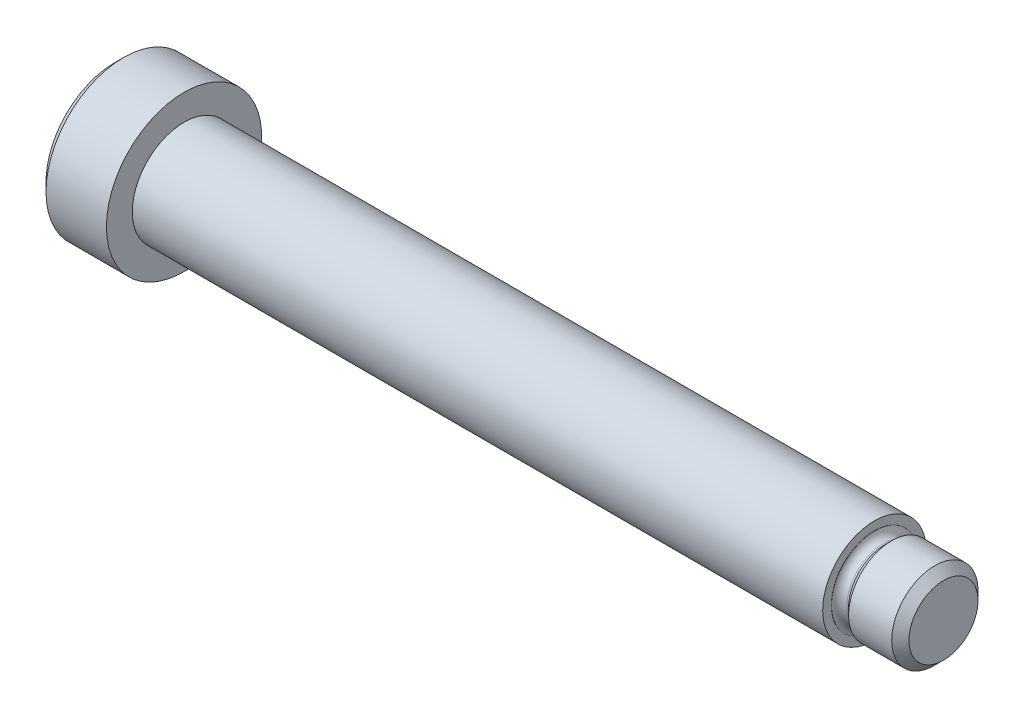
ISO-10303-21;
HEADER;
FILE_DESCRIPTION(('STEP AP214'),'2;1');
FILE_NAME('part.step','',(''),(''),'','','');
FILE_SCHEMA(('AUTOMOTIVE_DESIGN { 1 0 10303 214 1 1 1 1 }'));
ENDSEC;
DATA;
#1=APPLICATION_CONTEXT('core data for automotive mechanical design processes');
#2=APPLICATION_PROTOCOL_DEFINITION('international standard','automotive_design',2000,#1);
#3=PRODUCT_CONTEXT('',#1,'mechanical');
#4=PRODUCT('Part','Part','',(#3));
#5=PRODUCT_RELATED_PRODUCT_CATEGORY('part','',(#4));
#6=PRODUCT_DEFINITION_FORMATION('','',#4);
#7=PRODUCT_DEFINITION_CONTEXT('part definition',#1,'design');
#8=PRODUCT_DEFINITION('design','',#6,#7);
#9=PRODUCT_DEFINITION_SHAPE('','',#8);
#10=(LENGTH_UNIT() NAMED_UNIT(*) SI_UNIT(.MILLI.,.METRE.));
#11=(NAMED_UNIT(*) PLANE_ANGLE_UNIT() SI_UNIT($,.RADIAN.));
#12=(NAMED_UNIT(*) SI_UNIT($,.STERADIAN.) SOLID_ANGLE_UNIT());
#13=UNCERTAINTY_MEASURE_WITH_UNIT(LENGTH_MEASURE(1.E-05),#10,'distance_accuracy_value','');
#14=(GEOMETRIC_REPRESENTATION_CONTEXT(3) GLOBAL_UNCERTAINTY_ASSIGNED_CONTEXT((#13)) GLOBAL_UNIT_ASSIGNED_CONTEXT((#10,
#11,#12)) REPRESENTATION_CONTEXT('',''));
#15=CARTESIAN_POINT('',(0.,0.,0.));
#16=DIRECTION('',(0.,0.,1.));
#17=DIRECTION('',(1.,0.,0.));
#18=AXIS2_PLACEMENT_3D('',#15,#16,#17);
#19=CARTESIAN_POINT('',(0.,0.,0.));
#20=DIRECTION('',(-1.,0.,0.));
#21=DIRECTION('',(0.,0.,1.));
#22=AXIS2_PLACEMENT_3D('',#19,#20,#21);
#23=CYLINDRICAL_SURFACE('',#22,2.5);
#24=CARTESIAN_POINT('',(44.,0.,0.));
#25=DIRECTION('',(-1.,0.,0.));
#26=DIRECTION('',(0.,0.,1.));
#27=AXIS2_PLACEMENT_3D('',#24,#25,#26);
#28=CIRCLE('',#27,2.5);
#29=CARTESIAN_POINT('',(44.,0.,2.5));
#30=VERTEX_POINT('',#29);
#31=EDGE_CURVE('E144',#30,#30,#28,.T.);
#32=ORIENTED_EDGE('',*,*,#31,.F.);
#33=EDGE_LOOP('',(#32));
#34=FACE_BOUND('',#33,.T.);
#35=CARTESIAN_POINT('',(44.0101020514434,0.,0.));
#36=DIRECTION('',(1.,0.,0.));
#37=DIRECTION('',(0.,0.,-1.));
#38=AXIS2_PLACEMENT_3D('',#35,#36,#37);
#39=CIRCLE('',#38,2.5);
#40=CARTESIAN_POINT('',(44.0101020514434,0.,-2.5));
#41=VERTEX_POINT('',#40);
#42=EDGE_CURVE('E45',#41,#41,#39,.T.);
#43=ORIENTED_EDGE('',*,*,#42,.F.);
#44=EDGE_LOOP('',(#43));
#45=FACE_BOUND('',#44,.T.);
#46=ADVANCED_FACE('F41',(#34,#45),#23,.T.);
#47=CARTESIAN_POINT('',(0.,0.,0.));
#48=DIRECTION('',(1.,0.,0.));
#49=DIRECTION('',(0.,0.,-1.));
#50=AXIS2_PLACEMENT_3D('',#47,#48,#49);
#51=PLANE('',#50);
#52=DIRECTION('',(0.,0.5,0.866025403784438));
#53=VECTOR('',#52,1.);
#54=CARTESIAN_POINT('',(0.,-2.36713610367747,0.));
#55=LINE('',#54,#53);
#56=CARTESIAN_POINT('',(0.,-2.36713610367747,0.));
#57=VERTEX_POINT('',#56);
#58=CARTESIAN_POINT('',(0.,-1.18356805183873,2.05));
#59=VERTEX_POINT('',#58);
#60=EDGE_CURVE('E131',#57,#59,#55,.T.);
#61=ORIENTED_EDGE('',*,*,#60,.F.);
#62=DIRECTION('',(0.,-0.5,0.866025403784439));
#63=VECTOR('',#62,1.);
#64=CARTESIAN_POINT('',(0.,-1.18356805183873,-2.05));
#65=LINE('',#64,#63);
#66=CARTESIAN_POINT('',(0.,-1.18356805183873,-2.05));
#67=VERTEX_POINT('',#66);
#68=EDGE_CURVE('E57',#67,#57,#65,.T.);
#69=ORIENTED_EDGE('',*,*,#68,.F.);
#70=DIRECTION('',(0.,-1.,0.));
#71=VECTOR('',#70,1.);
#72=CARTESIAN_POINT('',(0.,1.18356805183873,-2.05));
#73=LINE('',#72,#71);
#74=CARTESIAN_POINT('',(0.,1.18356805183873,-2.05));
#75=VERTEX_POINT('',#74);
#76=EDGE_CURVE('E140',#75,#67,#73,.T.);
#77=ORIENTED_EDGE('',*,*,#76,.F.);
#78=DIRECTION('',(0.,-0.5,-0.866025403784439));
#79=VECTOR('',#78,1.);
#80=CARTESIAN_POINT('',(0.,2.36713610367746,0.));
#81=LINE('',#80,#79);
#82=CARTESIAN_POINT('',(0.,2.36713610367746,0.));
#83=VERTEX_POINT('',#82);
#84=EDGE_CURVE('E138',#83,#75,#81,.T.);
#85=ORIENTED_EDGE('',*,*,#84,.F.);
#86=DIRECTION('',(0.,0.5,-0.866025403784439));
#87=VECTOR('',#86,1.);
#88=CARTESIAN_POINT('',(0.,1.18356805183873,2.05));
#89=LINE('',#88,#87);
#90=CARTESIAN_POINT('',(0.,1.18356805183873,2.05));
#91=VERTEX_POINT('',#90);
#92=EDGE_CURVE('E105',#91,#83,#89,.T.);
#93=ORIENTED_EDGE('',*,*,#92,.F.);
#94=DIRECTION('',(0.,1.,0.));
#95=VECTOR('',#94,1.);
#96=CARTESIAN_POINT('',(0.,-1.18356805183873,2.05));
#97=LINE('',#96,#95);
#98=EDGE_CURVE('E134',#59,#91,#97,.T.);
#99=ORIENTED_EDGE('',*,*,#98,.F.);
#100=EDGE_LOOP('',(#61,#69,#77,#85,#93,#99));
#101=FACE_BOUND('',#100,.T.);
#102=CARTESIAN_POINT('',(0.,0.,0.));
#103=DIRECTION('',(1.,0.,0.));
#104=DIRECTION('',(0.,0.,-1.));
#105=AXIS2_PLACEMENT_3D('',#102,#103,#104);
#106=CIRCLE('',#105,4.);
#107=CARTESIAN_POINT('',(0.,0.,-4.));
#108=VERTEX_POINT('',#107);
#109=EDGE_CURVE('E50',#108,#108,#106,.F.);
#110=ORIENTED_EDGE('',*,*,#109,.T.);
#111=EDGE_LOOP('',(#110));
#112=FACE_BOUND('',#111,.T.);
#113=ADVANCED_FACE('F170',(#101,#112),#51,.F.);
#114=CARTESIAN_POINT('',(0.,0.,0.));
#115=DIRECTION('',(-1.,0.,0.));
#116=DIRECTION('',(0.,0.,1.));
#117=AXIS2_PLACEMENT_3D('',#114,#115,#116);
#118=CYLINDRICAL_SURFACE('',#117,4.5);
#119=CARTESIAN_POINT('',(0.500000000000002,0.,0.));
#120=DIRECTION('',(1.,0.,0.));
#121=DIRECTION('',(0.,0.,-1.));
#122=AXIS2_PLACEMENT_3D('',#119,#120,#121);
#123=CIRCLE('',#122,4.5);
#124=CARTESIAN_POINT('',(0.500000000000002,0.,-4.5));
#125=VERTEX_POINT('',#124);
#126=EDGE_CURVE('E11',#125,#125,#123,.T.);
#127=ORIENTED_EDGE('',*,*,#126,.T.);
#128=EDGE_LOOP('',(#127));
#129=FACE_BOUND('',#128,.T.);
#130=CARTESIAN_POINT('',(4.,0.,0.));
#131=DIRECTION('',(-1.,0.,0.));
#132=DIRECTION('',(0.,0.,1.));
#133=AXIS2_PLACEMENT_3D('',#130,#131,#132);
#134=CIRCLE('',#133,4.5);
#135=CARTESIAN_POINT('',(4.,0.,4.5));
#136=VERTEX_POINT('',#135);
#137=EDGE_CURVE('E158',#136,#136,#134,.T.);
#138=ORIENTED_EDGE('',*,*,#137,.T.);
#139=EDGE_LOOP('',(#138));
#140=FACE_BOUND('',#139,.T.);
#141=ADVANCED_FACE('F193',(#129,#140),#118,.T.);
#142=CARTESIAN_POINT('',(4.,4.5,0.));
#143=DIRECTION('',(-1.,0.,0.));
#144=DIRECTION('',(0.,0.,1.));
#145=AXIS2_PLACEMENT_3D('',#142,#143,#144);
#146=PLANE('',#145);
#147=ORIENTED_EDGE('',*,*,#137,.F.);
#148=EDGE_LOOP('',(#147));
#149=FACE_BOUND('',#148,.T.);
#150=CARTESIAN_POINT('',(4.,0.,0.));
#151=DIRECTION('',(-1.,0.,0.));
#152=DIRECTION('',(0.,0.,1.));
#153=AXIS2_PLACEMENT_3D('',#150,#151,#152);
#154=CIRCLE('',#153,3.);
#155=CARTESIAN_POINT('',(4.,0.,3.));
#156=VERTEX_POINT('',#155);
#157=EDGE_CURVE('E155',#156,#156,#154,.T.);
#158=ORIENTED_EDGE('',*,*,#157,.T.);
#159=EDGE_LOOP('',(#158));
#160=FACE_BOUND('',#159,.T.);
#161=ADVANCED_FACE('F382',(#149,#160),#146,.F.);
#162=CARTESIAN_POINT('',(0.,0.,0.));
#163=DIRECTION('',(-1.,0.,0.));
#164=DIRECTION('',(0.,0.,1.));
#165=AXIS2_PLACEMENT_3D('',#162,#163,#164);
#166=CYLINDRICAL_SURFACE('',#165,3.);
#167=ORIENTED_EDGE('',*,*,#157,.F.);
#168=EDGE_LOOP('',(#167));
#169=FACE_BOUND('',#168,.T.);
#170=CARTESIAN_POINT('',(44.,0.,0.));
#171=DIRECTION('',(-1.,0.,0.));
#172=DIRECTION('',(0.,0.,1.));
#173=AXIS2_PLACEMENT_3D('',#170,#171,#172);
#174=CIRCLE('',#173,3.);
#175=CARTESIAN_POINT('',(44.,0.,3.));
#176=VERTEX_POINT('',#175);
#177=EDGE_CURVE('E152',#176,#176,#174,.T.);
#178=ORIENTED_EDGE('',*,*,#177,.T.);
#179=EDGE_LOOP('',(#178));
#180=FACE_BOUND('',#179,.T.);
#181=ADVANCED_FACE('F182',(#169,#180),#166,.T.);
#182=CARTESIAN_POINT('',(44.,3.,0.));
#183=DIRECTION('',(-1.,0.,0.));
#184=DIRECTION('',(0.,0.,1.));
#185=AXIS2_PLACEMENT_3D('',#182,#183,#184);
#186=PLANE('',#185);
#187=ORIENTED_EDGE('',*,*,#31,.T.);
#188=EDGE_LOOP('',(#187));
#189=FACE_BOUND('',#188,.T.);
#190=ORIENTED_EDGE('',*,*,#177,.F.);
#191=EDGE_LOOP('',(#190));
#192=FACE_BOUND('',#191,.T.);
#193=ADVANCED_FACE('F174',(#189,#192),#186,.F.);
#194=CARTESIAN_POINT('',(0.,0.,0.));
#195=DIRECTION('',(1.,0.,0.));
#196=DIRECTION('',(0.,0.,-1.));
#197=AXIS2_PLACEMENT_3D('',#194,#195,#196);
#198=CONICAL_SURFACE('',#197,4.,0.785398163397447);
#199=ORIENTED_EDGE('',*,*,#126,.F.);
#200=EDGE_LOOP('',(#199));
#201=FACE_BOUND('',#200,.T.);
#202=ORIENTED_EDGE('',*,*,#109,.F.);
#203=EDGE_LOOP('',(#202));
#204=FACE_BOUND('',#203,.T.);
#205=ADVANCED_FACE('F43',(#201,#204),#198,.T.);
#206=CARTESIAN_POINT('',(3.,-1.18356805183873,-2.05));
#207=DIRECTION('',(0.,-0.866025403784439,-0.5));
#208=DIRECTION('',(0.,0.5,-0.866025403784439));
#209=AXIS2_PLACEMENT_3D('',#206,#207,#208);
#210=PLANE('',#209);
#211=ORIENTED_EDGE('',*,*,#68,.T.);
#212=DIRECTION('',(-1.,0.,0.));
#213=VECTOR('',#212,1.);
#214=CARTESIAN_POINT('',(3.,-2.36713610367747,0.));
#215=LINE('',#214,#213);
#216=CARTESIAN_POINT('',(3.,-2.36713610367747,0.));
#217=VERTEX_POINT('',#216);
#218=EDGE_CURVE('E87',#217,#57,#215,.T.);
#219=ORIENTED_EDGE('',*,*,#218,.F.);
#220=DIRECTION('',(0.,-0.5,0.866025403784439));
#221=VECTOR('',#220,1.);
#222=CARTESIAN_POINT('',(3.,-1.18356805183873,-2.05));
#223=LINE('',#222,#221);
#224=CARTESIAN_POINT('',(3.,-1.18356805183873,-2.05));
#225=VERTEX_POINT('',#224);
#226=EDGE_CURVE('E142',#225,#217,#223,.T.);
#227=ORIENTED_EDGE('',*,*,#226,.F.);
#228=DIRECTION('',(-1.,0.,0.));
#229=VECTOR('',#228,1.);
#230=CARTESIAN_POINT('',(3.,-1.18356805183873,-2.05));
#231=LINE('',#230,#229);
#232=EDGE_CURVE('E65',#225,#67,#231,.T.);
#233=ORIENTED_EDGE('',*,*,#232,.T.);
#234=EDGE_LOOP('',(#211,#219,#227,#233));
#235=FACE_BOUND('',#234,.T.);
#236=ADVANCED_FACE('F173',(#235),#210,.F.);
#237=CARTESIAN_POINT('',(3.,1.18356805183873,-2.05));
#238=DIRECTION('',(0.,0.,-1.));
#239=DIRECTION('',(-1.,0.,0.));
#240=AXIS2_PLACEMENT_3D('',#237,#238,#239);
#241=PLANE('',#240);
#242=ORIENTED_EDGE('',*,*,#76,.T.);
#243=ORIENTED_EDGE('',*,*,#232,.F.);
#244=DIRECTION('',(0.,-1.,0.));
#245=VECTOR('',#244,1.);
#246=CARTESIAN_POINT('',(3.,1.18356805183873,-2.05));
#247=LINE('',#246,#245);
#248=CARTESIAN_POINT('',(3.,1.18356805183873,-2.05));
#249=VERTEX_POINT('',#248);
#250=EDGE_CURVE('E117',#249,#225,#247,.T.);
#251=ORIENTED_EDGE('',*,*,#250,.F.);
#252=DIRECTION('',(-1.,0.,0.));
#253=VECTOR('',#252,1.);
#254=CARTESIAN_POINT('',(3.,1.18356805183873,-2.05));
#255=LINE('',#254,#253);
#256=EDGE_CURVE('E109',#249,#75,#255,.T.);
#257=ORIENTED_EDGE('',*,*,#256,.T.);
#258=EDGE_LOOP('',(#242,#243,#251,#257));
#259=FACE_BOUND('',#258,.T.);
#260=ADVANCED_FACE('F180',(#259),#241,.F.);
#261=CARTESIAN_POINT('',(3.,2.36713610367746,0.));
#262=DIRECTION('',(0.,0.866025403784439,-0.5));
#263=DIRECTION('',(0.,0.5,0.866025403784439));
#264=AXIS2_PLACEMENT_3D('',#261,#262,#263);
#265=PLANE('',#264);
#266=ORIENTED_EDGE('',*,*,#84,.T.);
#267=ORIENTED_EDGE('',*,*,#256,.F.);
#268=DIRECTION('',(0.,-0.5,-0.866025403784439));
#269=VECTOR('',#268,1.);
#270=CARTESIAN_POINT('',(3.,2.36713610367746,0.));
#271=LINE('',#270,#269);
#272=CARTESIAN_POINT('',(3.,2.36713610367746,0.));
#273=VERTEX_POINT('',#272);
#274=EDGE_CURVE('E113',#273,#249,#271,.T.);
#275=ORIENTED_EDGE('',*,*,#274,.F.);
#276=DIRECTION('',(-1.,0.,0.));
#277=VECTOR('',#276,1.);
#278=CARTESIAN_POINT('',(3.,2.36713610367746,0.));
#279=LINE('',#278,#277);
#280=EDGE_CURVE('E98',#273,#83,#279,.T.);
#281=ORIENTED_EDGE('',*,*,#280,.T.);
#282=EDGE_LOOP('',(#266,#267,#275,#281));
#283=FACE_BOUND('',#282,.T.);
#284=ADVANCED_FACE('F114',(#283),#265,.F.);
#285=CARTESIAN_POINT('',(3.,1.18356805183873,2.05));
#286=DIRECTION('',(0.,0.866025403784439,0.5));
#287=DIRECTION('',(0.,-0.5,0.866025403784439));
#288=AXIS2_PLACEMENT_3D('',#285,#286,#287);
#289=PLANE('',#288);
#290=ORIENTED_EDGE('',*,*,#92,.T.);
#291=ORIENTED_EDGE('',*,*,#280,.F.);
#292=DIRECTION('',(0.,0.5,-0.866025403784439));
#293=VECTOR('',#292,1.);
#294=CARTESIAN_POINT('',(3.,1.18356805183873,2.05));
#295=LINE('',#294,#293);
#296=CARTESIAN_POINT('',(3.,1.18356805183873,2.05));
#297=VERTEX_POINT('',#296);
#298=EDGE_CURVE('E102',#297,#273,#295,.T.);
#299=ORIENTED_EDGE('',*,*,#298,.F.);
#300=DIRECTION('',(-1.,0.,0.));
#301=VECTOR('',#300,1.);
#302=CARTESIAN_POINT('',(3.,1.18356805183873,2.05));
#303=LINE('',#302,#301);
#304=EDGE_CURVE('E110',#297,#91,#303,.T.);
#305=ORIENTED_EDGE('',*,*,#304,.T.);
#306=EDGE_LOOP('',(#290,#291,#299,#305));
#307=FACE_BOUND('',#306,.T.);
#308=ADVANCED_FACE('F100',(#307),#289,.F.);
#309=CARTESIAN_POINT('',(3.,-1.18356805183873,2.05));
#310=DIRECTION('',(0.,0.,1.));
#311=DIRECTION('',(0.,-1.,0.));
#312=AXIS2_PLACEMENT_3D('',#309,#310,#311);
#313=PLANE('',#312);
#314=ORIENTED_EDGE('',*,*,#98,.T.);
#315=ORIENTED_EDGE('',*,*,#304,.F.);
#316=DIRECTION('',(0.,1.,0.));
#317=VECTOR('',#316,1.);
#318=CARTESIAN_POINT('',(3.,-1.18356805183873,2.05));
#319=LINE('',#318,#317);
#320=CARTESIAN_POINT('',(3.,-1.18356805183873,2.05));
#321=VERTEX_POINT('',#320);
#322=EDGE_CURVE('E123',#321,#297,#319,.T.);
#323=ORIENTED_EDGE('',*,*,#322,.F.);
#324=DIRECTION('',(-1.,0.,0.));
#325=VECTOR('',#324,1.);
#326=CARTESIAN_POINT('',(3.,-1.18356805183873,2.05));
#327=LINE('',#326,#325);
#328=EDGE_CURVE('E147',#321,#59,#327,.T.);
#329=ORIENTED_EDGE('',*,*,#328,.T.);
#330=EDGE_LOOP('',(#314,#315,#323,#329));
#331=FACE_BOUND('',#330,.T.);
#332=ADVANCED_FACE('F226',(#331),#313,.F.);
#333=CARTESIAN_POINT('',(3.,-2.36713610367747,0.));
#334=DIRECTION('',(0.,-0.866025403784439,0.5));
#335=DIRECTION('',(0.,-0.5,-0.866025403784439));
#336=AXIS2_PLACEMENT_3D('',#333,#334,#335);
#337=PLANE('',#336);
#338=ORIENTED_EDGE('',*,*,#60,.T.);
#339=ORIENTED_EDGE('',*,*,#328,.F.);
#340=DIRECTION('',(0.,0.5,0.866025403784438));
#341=VECTOR('',#340,1.);
#342=CARTESIAN_POINT('',(3.,-2.36713610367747,0.));
#343=LINE('',#342,#341);
#344=EDGE_CURVE('E125',#217,#321,#343,.T.);
#345=ORIENTED_EDGE('',*,*,#344,.F.);
#346=ORIENTED_EDGE('',*,*,#218,.T.);
#347=EDGE_LOOP('',(#338,#339,#345,#346));
#348=FACE_BOUND('',#347,.T.);
#349=ADVANCED_FACE('F222',(#348),#337,.F.);
#350=CARTESIAN_POINT('',(3.,-2.36713610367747,0.));
#351=DIRECTION('',(-1.,0.,0.));
#352=DIRECTION('',(0.,0.,1.));
#353=AXIS2_PLACEMENT_3D('',#350,#351,#352);
#354=PLANE('',#353);
#355=ORIENTED_EDGE('',*,*,#226,.T.);
#356=ORIENTED_EDGE('',*,*,#344,.T.);
#357=ORIENTED_EDGE('',*,*,#322,.T.);
#358=ORIENTED_EDGE('',*,*,#298,.T.);
#359=ORIENTED_EDGE('',*,*,#274,.T.);
#360=ORIENTED_EDGE('',*,*,#250,.T.);
#361=EDGE_LOOP('',(#355,#356,#357,#358,#359,#360));
#362=FACE_BOUND('',#361,.T.);
#363=ADVANCED_FACE('F120',(#362),#354,.T.);
#364=CARTESIAN_POINT('',(44.5,0.,0.));
#365=DIRECTION('',(-1.,0.,0.));
#366=DIRECTION('',(0.,0.,1.));
#367=AXIS2_PLACEMENT_3D('',#364,#365,#366);
#368=TOROIDAL_SURFACE('',#367,2.6,0.5);
#369=CARTESIAN_POINT('',(44.5,0.,0.));
#370=DIRECTION('',(-1.,0.,0.));
#371=DIRECTION('',(0.,0.,1.));
#372=AXIS2_PLACEMENT_3D('',#369,#370,#371);
#373=CIRCLE('',#372,2.1);
#374=CARTESIAN_POINT('',(44.5,0.,2.1));
#375=VERTEX_POINT('',#374);
#376=EDGE_CURVE('E216',#375,#375,#373,.T.);
#377=ORIENTED_EDGE('',*,*,#376,.T.);
#378=EDGE_LOOP('',(#377));
#379=FACE_BOUND('',#378,.T.);
#380=ORIENTED_EDGE('',*,*,#42,.T.);
#381=EDGE_LOOP('',(#380));
#382=FACE_BOUND('',#381,.T.);
#383=ADVANCED_FACE('F255',(#379,#382),#368,.F.);
#384=CARTESIAN_POINT('',(0.,0.,0.));
#385=DIRECTION('',(-1.,0.,0.));
#386=DIRECTION('',(0.,0.,1.));
#387=AXIS2_PLACEMENT_3D('',#384,#385,#386);
#388=CYLINDRICAL_SURFACE('',#387,2.1);
#389=CARTESIAN_POINT('',(44.6,0.,0.));
#390=DIRECTION('',(-1.,0.,0.));
#391=DIRECTION('',(0.,0.,1.));
#392=AXIS2_PLACEMENT_3D('',#389,#390,#391);
#393=CIRCLE('',#392,2.1);
#394=CARTESIAN_POINT('',(44.6,0.,2.1));
#395=VERTEX_POINT('',#394);
#396=EDGE_CURVE('E213',#395,#395,#393,.T.);
#397=ORIENTED_EDGE('',*,*,#396,.T.);
#398=EDGE_LOOP('',(#397));
#399=FACE_BOUND('',#398,.T.);
#400=ORIENTED_EDGE('',*,*,#376,.F.);
#401=EDGE_LOOP('',(#400));
#402=FACE_BOUND('',#401,.T.);
#403=ADVANCED_FACE('F248',(#399,#402),#388,.T.);
#404=CARTESIAN_POINT('',(44.6,0.,0.));
#405=DIRECTION('',(1.,0.,0.));
#406=DIRECTION('',(0.,0.,-1.));
#407=AXIS2_PLACEMENT_3D('',#404,#405,#406);
#408=CONICAL_SURFACE('',#407,2.1,0.785398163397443);
#409=CARTESIAN_POINT('',(45.,0.,0.));
#410=DIRECTION('',(-1.,0.,0.));
#411=DIRECTION('',(0.,0.,1.));
#412=AXIS2_PLACEMENT_3D('',#409,#410,#411);
#413=CIRCLE('',#412,2.5);
#414=CARTESIAN_POINT('',(45.,0.,2.5));
#415=VERTEX_POINT('',#414);
#416=EDGE_CURVE('E211',#415,#415,#413,.T.);
#417=ORIENTED_EDGE('',*,*,#416,.T.);
#418=EDGE_LOOP('',(#417));
#419=FACE_BOUND('',#418,.T.);
#420=ORIENTED_EDGE('',*,*,#396,.F.);
#421=EDGE_LOOP('',(#420));
#422=FACE_BOUND('',#421,.T.);
#423=ADVANCED_FACE('F243',(#419,#422),#408,.T.);
#424=CARTESIAN_POINT('',(48.,2.5,0.));
#425=DIRECTION('',(-1.,0.,0.));
#426=DIRECTION('',(0.,0.,1.));
#427=AXIS2_PLACEMENT_3D('',#424,#425,#426);
#428=PLANE('',#427);
#429=CARTESIAN_POINT('',(48.,0.,0.));
#430=DIRECTION('',(-1.,0.,0.));
#431=DIRECTION('',(0.,0.,1.));
#432=AXIS2_PLACEMENT_3D('',#429,#430,#431);
#433=CIRCLE('',#432,2.);
#434=CARTESIAN_POINT('',(48.,0.,2.));
#435=VERTEX_POINT('',#434);
#436=EDGE_CURVE('E164',#435,#435,#433,.F.);
#437=ORIENTED_EDGE('',*,*,#436,.T.);
#438=EDGE_LOOP('',(#437));
#439=FACE_BOUND('',#438,.T.);
#440=ADVANCED_FACE('F205',(#439),#428,.F.);
#441=CARTESIAN_POINT('',(47.5,0.,0.));
#442=DIRECTION('',(-1.,0.,0.));
#443=DIRECTION('',(0.,0.,1.));
#444=AXIS2_PLACEMENT_3D('',#441,#442,#443);
#445=CONICAL_SURFACE('',#444,2.5,0.785398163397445);
#446=ORIENTED_EDGE('',*,*,#436,.F.);
#447=EDGE_LOOP('',(#446));
#448=FACE_BOUND('',#447,.T.);
#449=CARTESIAN_POINT('',(47.5,0.,0.));
#450=DIRECTION('',(-1.,0.,0.));
#451=DIRECTION('',(0.,0.,1.));
#452=AXIS2_PLACEMENT_3D('',#449,#450,#451);
#453=CIRCLE('',#452,2.5);
#454=CARTESIAN_POINT('',(47.5,0.,2.5));
#455=VERTEX_POINT('',#454);
#456=EDGE_CURVE('E161',#455,#455,#453,.T.);
#457=ORIENTED_EDGE('',*,*,#456,.F.);
#458=EDGE_LOOP('',(#457));
#459=FACE_BOUND('',#458,.T.);
#460=ADVANCED_FACE('F200',(#448,#459),#445,.T.);
#461=ORIENTED_EDGE('',*,*,#456,.T.);
#462=EDGE_LOOP('',(#461));
#463=FACE_BOUND('',#462,.T.);
#464=ORIENTED_EDGE('',*,*,#416,.F.);
#465=EDGE_LOOP('',(#464));
#466=FACE_BOUND('',#465,.T.);
#467=ADVANCED_FACE('F189',(#463,#466),#23,.T.);
#468=CLOSED_SHELL('',(#46,#113,#141,#161,#181,#193,#205,#236,#260,#284,#308,#332,#349,#363,#383,
#403,#423,#440,#460,#467));
#469=MANIFOLD_SOLID_BREP('B2',#468);
#470=ADVANCED_BREP_SHAPE_REPRESENTATION('',(#18,#469),#14);
#471=SHAPE_DEFINITION_REPRESENTATION(#9,#470);
ENDSEC;
END-ISO-10303-21;
